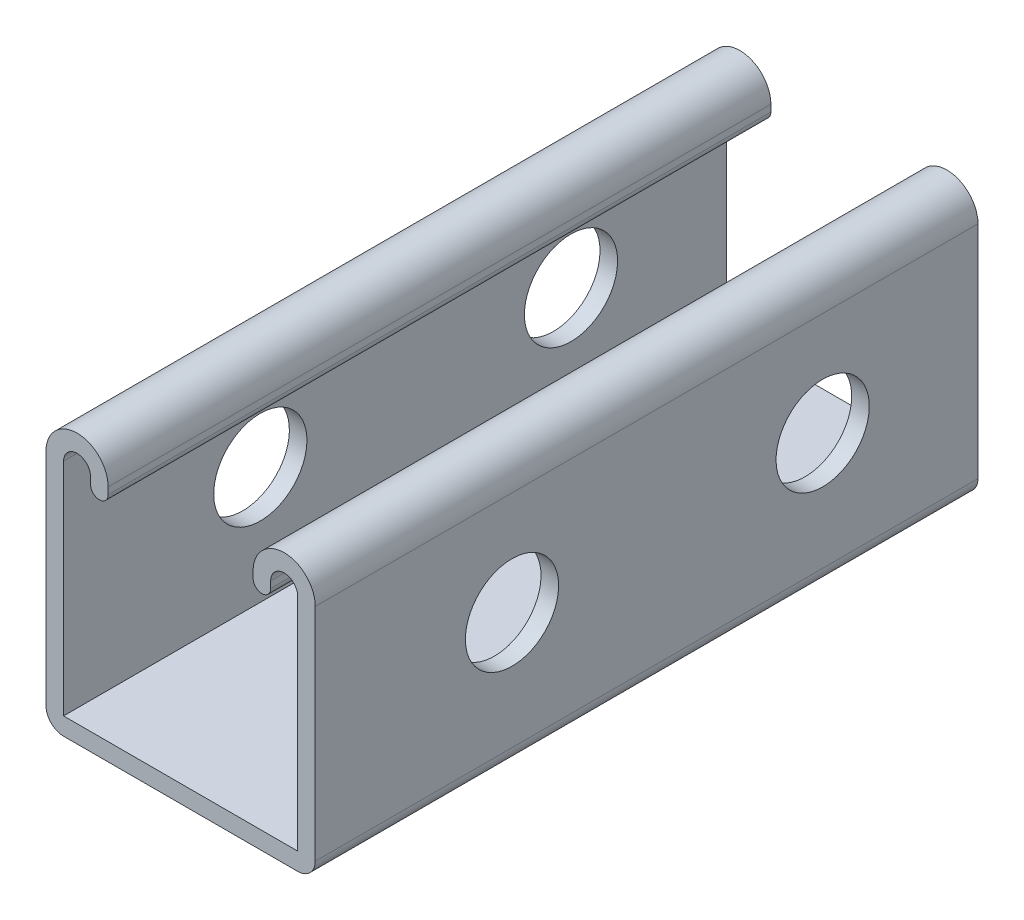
ISO-10303-21;
HEADER;
FILE_DESCRIPTION(('STEP AP214'),'2;1');
FILE_NAME('part.step','',(''),(''),'','','');
FILE_SCHEMA(('AUTOMOTIVE_DESIGN { 1 0 10303 214 1 1 1 1 }'));
ENDSEC;
DATA;
#1=APPLICATION_CONTEXT('core data for automotive mechanical design processes');
#2=APPLICATION_PROTOCOL_DEFINITION('international standard','automotive_design',2000,#1);
#3=PRODUCT_CONTEXT('',#1,'mechanical');
#4=PRODUCT('Part','Part','',(#3));
#5=PRODUCT_RELATED_PRODUCT_CATEGORY('part','',(#4));
#6=PRODUCT_DEFINITION_FORMATION('','',#4);
#7=PRODUCT_DEFINITION_CONTEXT('part definition',#1,'design');
#8=PRODUCT_DEFINITION('design','',#6,#7);
#9=PRODUCT_DEFINITION_SHAPE('','',#8);
#10=(LENGTH_UNIT() NAMED_UNIT(*) SI_UNIT(.MILLI.,.METRE.));
#11=(NAMED_UNIT(*) PLANE_ANGLE_UNIT() SI_UNIT($,.RADIAN.));
#12=(NAMED_UNIT(*) SI_UNIT($,.STERADIAN.) SOLID_ANGLE_UNIT());
#13=UNCERTAINTY_MEASURE_WITH_UNIT(LENGTH_MEASURE(1.E-05),#10,'distance_accuracy_value','');
#14=(GEOMETRIC_REPRESENTATION_CONTEXT(3) GLOBAL_UNCERTAINTY_ASSIGNED_CONTEXT((#13)) GLOBAL_UNIT_ASSIGNED_CONTEXT((#10,
#11,#12)) REPRESENTATION_CONTEXT('',''));
#15=CARTESIAN_POINT('',(0.,0.,0.));
#16=DIRECTION('',(0.,0.,1.));
#17=DIRECTION('',(1.,0.,0.));
#18=AXIS2_PLACEMENT_3D('',#15,#16,#17);
#19=CARTESIAN_POINT('',(-15.875,15.875,101.6));
#20=DIRECTION('',(0.,0.,-1.));
#21=DIRECTION('',(-1.,0.,0.));
#22=AXIS2_PLACEMENT_3D('',#19,#20,#21);
#23=CYLINDRICAL_SURFACE('',#22,4.7625);
#24=CARTESIAN_POINT('',(-15.875,15.875,0.));
#25=DIRECTION('',(0.,0.,1.));
#26=DIRECTION('',(-1.,0.,0.));
#27=AXIS2_PLACEMENT_3D('',#24,#25,#26);
#28=CIRCLE('',#27,4.7625);
#29=CARTESIAN_POINT('',(-11.1125,15.875,0.));
#30=VERTEX_POINT('',#29);
#31=CARTESIAN_POINT('',(-20.6375,15.875,0.));
#32=VERTEX_POINT('',#31);
#33=EDGE_CURVE('E197',#30,#32,#28,.T.);
#34=ORIENTED_EDGE('',*,*,#33,.T.);
#35=DIRECTION('',(0.,0.,-1.));
#36=VECTOR('',#35,1.);
#37=CARTESIAN_POINT('',(-20.6375,15.875,101.6));
#38=LINE('',#37,#36);
#39=CARTESIAN_POINT('',(-20.6375,15.875,101.6));
#40=VERTEX_POINT('',#39);
#41=EDGE_CURVE('E11',#40,#32,#38,.T.);
#42=ORIENTED_EDGE('',*,*,#41,.F.);
#43=CARTESIAN_POINT('',(-15.875,15.875,101.6));
#44=DIRECTION('',(0.,0.,1.));
#45=DIRECTION('',(-1.,0.,0.));
#46=AXIS2_PLACEMENT_3D('',#43,#44,#45);
#47=CIRCLE('',#46,4.7625);
#48=CARTESIAN_POINT('',(-11.1125,15.875,101.6));
#49=VERTEX_POINT('',#48);
#50=EDGE_CURVE('E232',#49,#40,#47,.T.);
#51=ORIENTED_EDGE('',*,*,#50,.F.);
#52=DIRECTION('',(0.,0.,-1.));
#53=VECTOR('',#52,1.);
#54=CARTESIAN_POINT('',(-11.1125,15.875,101.6));
#55=LINE('',#54,#53);
#56=EDGE_CURVE('E193',#49,#30,#55,.T.);
#57=ORIENTED_EDGE('',*,*,#56,.T.);
#58=EDGE_LOOP('',(#34,#42,#51,#57));
#59=FACE_BOUND('',#58,.T.);
#60=ADVANCED_FACE('F39',(#59),#23,.T.);
#61=CARTESIAN_POINT('',(-20.6375,15.875,101.6));
#62=DIRECTION('',(1.,0.,0.));
#63=DIRECTION('',(0.,1.,0.));
#64=AXIS2_PLACEMENT_3D('',#61,#62,#63);
#65=PLANE('',#64);
#66=CARTESIAN_POINT('',(-20.6375000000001,0.,71.4375));
#67=DIRECTION('',(1.,0.,0.));
#68=DIRECTION('',(0.,1.,0.));
#69=AXIS2_PLACEMENT_3D('',#66,#67,#68);
#70=CIRCLE('',#69,7.14375);
#71=CARTESIAN_POINT('',(-20.6375000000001,7.14374999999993,71.4375));
#72=VERTEX_POINT('',#71);
#73=EDGE_CURVE('E510',#72,#72,#70,.T.);
#74=ORIENTED_EDGE('',*,*,#73,.T.);
#75=EDGE_LOOP('',(#74));
#76=FACE_BOUND('',#75,.T.);
#77=CARTESIAN_POINT('',(-20.6375000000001,0.,23.8125));
#78=DIRECTION('',(1.,0.,0.));
#79=DIRECTION('',(0.,1.,0.));
#80=AXIS2_PLACEMENT_3D('',#77,#78,#79);
#81=CIRCLE('',#80,7.14375);
#82=CARTESIAN_POINT('',(-20.6375000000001,7.14374999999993,23.8125));
#83=VERTEX_POINT('',#82);
#84=EDGE_CURVE('E279',#83,#83,#81,.T.);
#85=ORIENTED_EDGE('',*,*,#84,.T.);
#86=EDGE_LOOP('',(#85));
#87=FACE_BOUND('',#86,.T.);
#88=DIRECTION('',(0.,-1.,0.));
#89=VECTOR('',#88,1.);
#90=CARTESIAN_POINT('',(-20.6375,15.875,0.));
#91=LINE('',#90,#89);
#92=CARTESIAN_POINT('',(-20.6375,-17.9451,0.));
#93=VERTEX_POINT('',#92);
#94=EDGE_CURVE('E200',#32,#93,#91,.T.);
#95=ORIENTED_EDGE('',*,*,#94,.T.);
#96=DIRECTION('',(0.,0.,-1.));
#97=VECTOR('',#96,1.);
#98=CARTESIAN_POINT('',(-20.6375,-17.9451,101.6));
#99=LINE('',#98,#97);
#100=CARTESIAN_POINT('',(-20.6375,-17.9451,101.6));
#101=VERTEX_POINT('',#100);
#102=EDGE_CURVE('E48',#101,#93,#99,.T.);
#103=ORIENTED_EDGE('',*,*,#102,.F.);
#104=DIRECTION('',(0.,-1.,0.));
#105=VECTOR('',#104,1.);
#106=CARTESIAN_POINT('',(-20.6375,15.875,101.6));
#107=LINE('',#106,#105);
#108=EDGE_CURVE('E130',#40,#101,#107,.T.);
#109=ORIENTED_EDGE('',*,*,#108,.F.);
#110=ORIENTED_EDGE('',*,*,#41,.T.);
#111=EDGE_LOOP('',(#95,#103,#109,#110));
#112=FACE_BOUND('',#111,.T.);
#113=ADVANCED_FACE('F356',(#76,#87,#112),#65,.F.);
#114=CARTESIAN_POINT('',(-17.9451,-17.9451,101.6));
#115=DIRECTION('',(0.,0.,-1.));
#116=DIRECTION('',(-1.,0.,0.));
#117=AXIS2_PLACEMENT_3D('',#114,#115,#116);
#118=CYLINDRICAL_SURFACE('',#117,2.6924);
#119=CARTESIAN_POINT('',(-17.9451,-17.9451,0.));
#120=DIRECTION('',(0.,0.,1.));
#121=DIRECTION('',(-1.,0.,0.));
#122=AXIS2_PLACEMENT_3D('',#119,#120,#121);
#123=CIRCLE('',#122,2.6924);
#124=CARTESIAN_POINT('',(-17.9451,-20.6375,0.));
#125=VERTEX_POINT('',#124);
#126=EDGE_CURVE('E203',#93,#125,#123,.T.);
#127=ORIENTED_EDGE('',*,*,#126,.T.);
#128=DIRECTION('',(0.,0.,-1.));
#129=VECTOR('',#128,1.);
#130=CARTESIAN_POINT('',(-17.9451,-20.6375,101.6));
#131=LINE('',#130,#129);
#132=CARTESIAN_POINT('',(-17.9451,-20.6375,101.6));
#133=VERTEX_POINT('',#132);
#134=EDGE_CURVE('E269',#133,#125,#131,.T.);
#135=ORIENTED_EDGE('',*,*,#134,.F.);
#136=CARTESIAN_POINT('',(-17.9451,-17.9451,101.6));
#137=DIRECTION('',(0.,0.,1.));
#138=DIRECTION('',(-1.,0.,0.));
#139=AXIS2_PLACEMENT_3D('',#136,#137,#138);
#140=CIRCLE('',#139,2.6924);
#141=EDGE_CURVE('E305',#101,#133,#140,.T.);
#142=ORIENTED_EDGE('',*,*,#141,.F.);
#143=ORIENTED_EDGE('',*,*,#102,.T.);
#144=EDGE_LOOP('',(#127,#135,#142,#143));
#145=FACE_BOUND('',#144,.T.);
#146=ADVANCED_FACE('F361',(#145),#118,.T.);
#147=CARTESIAN_POINT('',(-17.9451,-20.6375,101.6));
#148=DIRECTION('',(0.,1.,0.));
#149=DIRECTION('',(-1.,0.,0.));
#150=AXIS2_PLACEMENT_3D('',#147,#148,#149);
#151=PLANE('',#150);
#152=CARTESIAN_POINT('',(0.,-20.6375,71.4375));
#153=DIRECTION('',(0.,-1.,0.));
#154=DIRECTION('',(1.,0.,0.));
#155=AXIS2_PLACEMENT_3D('',#152,#153,#154);
#156=CIRCLE('',#155,7.14375);
#157=CARTESIAN_POINT('',(7.14375,-20.6375,71.4375));
#158=VERTEX_POINT('',#157);
#159=EDGE_CURVE('E283',#158,#158,#156,.T.);
#160=ORIENTED_EDGE('',*,*,#159,.F.);
#161=EDGE_LOOP('',(#160));
#162=FACE_BOUND('',#161,.T.);
#163=CARTESIAN_POINT('',(0.,-20.6375,23.8125));
#164=DIRECTION('',(0.,-1.,0.));
#165=DIRECTION('',(1.,0.,0.));
#166=AXIS2_PLACEMENT_3D('',#163,#164,#165);
#167=CIRCLE('',#166,7.14375);
#168=CARTESIAN_POINT('',(7.14375,-20.6375,23.8125));
#169=VERTEX_POINT('',#168);
#170=EDGE_CURVE('E275',#169,#169,#167,.T.);
#171=ORIENTED_EDGE('',*,*,#170,.F.);
#172=EDGE_LOOP('',(#171));
#173=FACE_BOUND('',#172,.T.);
#174=DIRECTION('',(1.,0.,0.));
#175=VECTOR('',#174,1.);
#176=CARTESIAN_POINT('',(-17.9451,-20.6375,0.));
#177=LINE('',#176,#175);
#178=CARTESIAN_POINT('',(17.9451,-20.6375,0.));
#179=VERTEX_POINT('',#178);
#180=EDGE_CURVE('E205',#125,#179,#177,.T.);
#181=ORIENTED_EDGE('',*,*,#180,.T.);
#182=DIRECTION('',(0.,0.,-1.));
#183=VECTOR('',#182,1.);
#184=CARTESIAN_POINT('',(17.9451,-20.6375,101.6));
#185=LINE('',#184,#183);
#186=CARTESIAN_POINT('',(17.9451,-20.6375,101.6));
#187=VERTEX_POINT('',#186);
#188=EDGE_CURVE('E266',#187,#179,#185,.T.);
#189=ORIENTED_EDGE('',*,*,#188,.F.);
#190=DIRECTION('',(1.,0.,0.));
#191=VECTOR('',#190,1.);
#192=CARTESIAN_POINT('',(-17.9451,-20.6375,101.6));
#193=LINE('',#192,#191);
#194=EDGE_CURVE('E307',#133,#187,#193,.T.);
#195=ORIENTED_EDGE('',*,*,#194,.F.);
#196=ORIENTED_EDGE('',*,*,#134,.T.);
#197=EDGE_LOOP('',(#181,#189,#195,#196));
#198=FACE_BOUND('',#197,.T.);
#199=ADVANCED_FACE('F367',(#162,#173,#198),#151,.F.);
#200=CARTESIAN_POINT('',(17.9451,-17.9451,101.6));
#201=DIRECTION('',(0.,0.,-1.));
#202=DIRECTION('',(-1.,0.,0.));
#203=AXIS2_PLACEMENT_3D('',#200,#201,#202);
#204=CYLINDRICAL_SURFACE('',#203,2.6924);
#205=CARTESIAN_POINT('',(17.9451,-17.9451,0.));
#206=DIRECTION('',(0.,0.,1.));
#207=DIRECTION('',(1.,0.,0.));
#208=AXIS2_PLACEMENT_3D('',#205,#206,#207);
#209=CIRCLE('',#208,2.6924);
#210=CARTESIAN_POINT('',(20.6375,-17.9451,0.));
#211=VERTEX_POINT('',#210);
#212=EDGE_CURVE('E207',#179,#211,#209,.T.);
#213=ORIENTED_EDGE('',*,*,#212,.T.);
#214=DIRECTION('',(0.,0.,-1.));
#215=VECTOR('',#214,1.);
#216=CARTESIAN_POINT('',(20.6375,-17.9451,101.6));
#217=LINE('',#216,#215);
#218=CARTESIAN_POINT('',(20.6375,-17.9451,101.6));
#219=VERTEX_POINT('',#218);
#220=EDGE_CURVE('E263',#219,#211,#217,.T.);
#221=ORIENTED_EDGE('',*,*,#220,.F.);
#222=CARTESIAN_POINT('',(17.9451,-17.9451,101.6));
#223=DIRECTION('',(0.,0.,1.));
#224=DIRECTION('',(1.,0.,0.));
#225=AXIS2_PLACEMENT_3D('',#222,#223,#224);
#226=CIRCLE('',#225,2.6924);
#227=EDGE_CURVE('E309',#187,#219,#226,.T.);
#228=ORIENTED_EDGE('',*,*,#227,.F.);
#229=ORIENTED_EDGE('',*,*,#188,.T.);
#230=EDGE_LOOP('',(#213,#221,#228,#229));
#231=FACE_BOUND('',#230,.T.);
#232=ADVANCED_FACE('F374',(#231),#204,.T.);
#233=CARTESIAN_POINT('',(20.6375,-17.9451,101.6));
#234=DIRECTION('',(-1.,0.,0.));
#235=DIRECTION('',(0.,0.,1.));
#236=AXIS2_PLACEMENT_3D('',#233,#234,#235);
#237=PLANE('',#236);
#238=CARTESIAN_POINT('',(20.6375,0.,71.4375));
#239=DIRECTION('',(1.,0.,0.));
#240=DIRECTION('',(0.,1.,0.));
#241=AXIS2_PLACEMENT_3D('',#238,#239,#240);
#242=CIRCLE('',#241,7.14375);
#243=CARTESIAN_POINT('',(20.6375,7.14375000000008,71.4375));
#244=VERTEX_POINT('',#243);
#245=EDGE_CURVE('E506',#244,#244,#242,.T.);
#246=ORIENTED_EDGE('',*,*,#245,.F.);
#247=EDGE_LOOP('',(#246));
#248=FACE_BOUND('',#247,.T.);
#249=CARTESIAN_POINT('',(20.6375,0.,23.8125));
#250=DIRECTION('',(1.,0.,0.));
#251=DIRECTION('',(0.,1.,0.));
#252=AXIS2_PLACEMENT_3D('',#249,#250,#251);
#253=CIRCLE('',#252,7.14375);
#254=CARTESIAN_POINT('',(20.6375,7.14375000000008,23.8125));
#255=VERTEX_POINT('',#254);
#256=EDGE_CURVE('E286',#255,#255,#253,.T.);
#257=ORIENTED_EDGE('',*,*,#256,.F.);
#258=EDGE_LOOP('',(#257));
#259=FACE_BOUND('',#258,.T.);
#260=DIRECTION('',(0.,1.,0.));
#261=VECTOR('',#260,1.);
#262=CARTESIAN_POINT('',(20.6375,-17.9451,0.));
#263=LINE('',#262,#261);
#264=CARTESIAN_POINT('',(20.6375,15.875,0.));
#265=VERTEX_POINT('',#264);
#266=EDGE_CURVE('E209',#211,#265,#263,.T.);
#267=ORIENTED_EDGE('',*,*,#266,.T.);
#268=DIRECTION('',(0.,0.,-1.));
#269=VECTOR('',#268,1.);
#270=CARTESIAN_POINT('',(20.6375,15.875,101.6));
#271=LINE('',#270,#269);
#272=CARTESIAN_POINT('',(20.6375,15.875,101.6));
#273=VERTEX_POINT('',#272);
#274=EDGE_CURVE('E260',#273,#265,#271,.T.);
#275=ORIENTED_EDGE('',*,*,#274,.F.);
#276=DIRECTION('',(0.,1.,0.));
#277=VECTOR('',#276,1.);
#278=CARTESIAN_POINT('',(20.6375,-17.9451,101.6));
#279=LINE('',#278,#277);
#280=EDGE_CURVE('E311',#219,#273,#279,.T.);
#281=ORIENTED_EDGE('',*,*,#280,.F.);
#282=ORIENTED_EDGE('',*,*,#220,.T.);
#283=EDGE_LOOP('',(#267,#275,#281,#282));
#284=FACE_BOUND('',#283,.T.);
#285=ADVANCED_FACE('F378',(#248,#259,#284),#237,.F.);
#286=CARTESIAN_POINT('',(15.875,15.875,101.6));
#287=DIRECTION('',(0.,0.,-1.));
#288=DIRECTION('',(-1.,0.,0.));
#289=AXIS2_PLACEMENT_3D('',#286,#287,#288);
#290=CYLINDRICAL_SURFACE('',#289,4.7625);
#291=CARTESIAN_POINT('',(15.875,15.875,0.));
#292=DIRECTION('',(0.,0.,1.));
#293=DIRECTION('',(1.,0.,0.));
#294=AXIS2_PLACEMENT_3D('',#291,#292,#293);
#295=CIRCLE('',#294,4.7625);
#296=CARTESIAN_POINT('',(11.1125,15.875,0.));
#297=VERTEX_POINT('',#296);
#298=EDGE_CURVE('E211',#265,#297,#295,.T.);
#299=ORIENTED_EDGE('',*,*,#298,.T.);
#300=DIRECTION('',(0.,0.,-1.));
#301=VECTOR('',#300,1.);
#302=CARTESIAN_POINT('',(11.1125,15.875,101.6));
#303=LINE('',#302,#301);
#304=CARTESIAN_POINT('',(11.1125,15.875,101.6));
#305=VERTEX_POINT('',#304);
#306=EDGE_CURVE('E257',#305,#297,#303,.T.);
#307=ORIENTED_EDGE('',*,*,#306,.F.);
#308=CARTESIAN_POINT('',(15.875,15.875,101.6));
#309=DIRECTION('',(0.,0.,1.));
#310=DIRECTION('',(1.,0.,0.));
#311=AXIS2_PLACEMENT_3D('',#308,#309,#310);
#312=CIRCLE('',#311,4.7625);
#313=EDGE_CURVE('E313',#273,#305,#312,.T.);
#314=ORIENTED_EDGE('',*,*,#313,.F.);
#315=ORIENTED_EDGE('',*,*,#274,.T.);
#316=EDGE_LOOP('',(#299,#307,#314,#315));
#317=FACE_BOUND('',#316,.T.);
#318=ADVANCED_FACE('F381',(#317),#290,.T.);
#319=CARTESIAN_POINT('',(11.1125,15.875,101.6));
#320=DIRECTION('',(1.,0.,0.));
#321=DIRECTION('',(0.,1.,0.));
#322=AXIS2_PLACEMENT_3D('',#319,#320,#321);
#323=PLANE('',#322);
#324=DIRECTION('',(0.,-1.,0.));
#325=VECTOR('',#324,1.);
#326=CARTESIAN_POINT('',(11.1125,15.875,0.));
#327=LINE('',#326,#325);
#328=CARTESIAN_POINT('',(11.1125,14.83995,0.));
#329=VERTEX_POINT('',#328);
#330=EDGE_CURVE('E213',#297,#329,#327,.T.);
#331=ORIENTED_EDGE('',*,*,#330,.T.);
#332=DIRECTION('',(0.,0.,-1.));
#333=VECTOR('',#332,1.);
#334=CARTESIAN_POINT('',(11.1125,14.83995,101.6));
#335=LINE('',#334,#333);
#336=CARTESIAN_POINT('',(11.1125,14.83995,101.6));
#337=VERTEX_POINT('',#336);
#338=EDGE_CURVE('E254',#337,#329,#335,.T.);
#339=ORIENTED_EDGE('',*,*,#338,.F.);
#340=DIRECTION('',(0.,-1.,0.));
#341=VECTOR('',#340,1.);
#342=CARTESIAN_POINT('',(11.1125,15.875,101.6));
#343=LINE('',#342,#341);
#344=EDGE_CURVE('E315',#305,#337,#343,.T.);
#345=ORIENTED_EDGE('',*,*,#344,.F.);
#346=ORIENTED_EDGE('',*,*,#306,.T.);
#347=EDGE_LOOP('',(#331,#339,#345,#346));
#348=FACE_BOUND('',#347,.T.);
#349=ADVANCED_FACE('F385',(#348),#323,.F.);
#350=CARTESIAN_POINT('',(12.4587,14.83995,101.6));
#351=DIRECTION('',(0.,0.,-1.));
#352=DIRECTION('',(-1.,0.,0.));
#353=AXIS2_PLACEMENT_3D('',#350,#351,#352);
#354=CYLINDRICAL_SURFACE('',#353,1.3462);
#355=CARTESIAN_POINT('',(12.4587,14.83995,0.));
#356=DIRECTION('',(0.,0.,1.));
#357=DIRECTION('',(1.,0.,0.));
#358=AXIS2_PLACEMENT_3D('',#355,#356,#357);
#359=CIRCLE('',#358,1.3462);
#360=CARTESIAN_POINT('',(13.8049,14.83995,0.));
#361=VERTEX_POINT('',#360);
#362=EDGE_CURVE('E215',#329,#361,#359,.T.);
#363=ORIENTED_EDGE('',*,*,#362,.T.);
#364=DIRECTION('',(0.,0.,-1.));
#365=VECTOR('',#364,1.);
#366=CARTESIAN_POINT('',(13.8049,14.83995,101.6));
#367=LINE('',#366,#365);
#368=CARTESIAN_POINT('',(13.8049,14.83995,101.6));
#369=VERTEX_POINT('',#368);
#370=EDGE_CURVE('E251',#369,#361,#367,.T.);
#371=ORIENTED_EDGE('',*,*,#370,.F.);
#372=CARTESIAN_POINT('',(12.4587,14.83995,101.6));
#373=DIRECTION('',(0.,0.,1.));
#374=DIRECTION('',(1.,0.,0.));
#375=AXIS2_PLACEMENT_3D('',#372,#373,#374);
#376=CIRCLE('',#375,1.3462);
#377=EDGE_CURVE('E317',#337,#369,#376,.T.);
#378=ORIENTED_EDGE('',*,*,#377,.F.);
#379=ORIENTED_EDGE('',*,*,#338,.T.);
#380=EDGE_LOOP('',(#363,#371,#378,#379));
#381=FACE_BOUND('',#380,.T.);
#382=ADVANCED_FACE('F389',(#381),#354,.T.);
#383=CARTESIAN_POINT('',(13.8049,15.875,101.6));
#384=DIRECTION('',(-1.,0.,0.));
#385=DIRECTION('',(0.,0.,1.));
#386=AXIS2_PLACEMENT_3D('',#383,#384,#385);
#387=PLANE('',#386);
#388=DIRECTION('',(0.,1.,0.));
#389=VECTOR('',#388,1.);
#390=CARTESIAN_POINT('',(13.8049,15.875,0.));
#391=LINE('',#390,#389);
#392=CARTESIAN_POINT('',(13.8049,15.875,0.));
#393=VERTEX_POINT('',#392);
#394=EDGE_CURVE('E217',#361,#393,#391,.T.);
#395=ORIENTED_EDGE('',*,*,#394,.T.);
#396=DIRECTION('',(0.,0.,-1.));
#397=VECTOR('',#396,1.);
#398=CARTESIAN_POINT('',(13.8049,15.875,101.6));
#399=LINE('',#398,#397);
#400=CARTESIAN_POINT('',(13.8049,15.875,101.6));
#401=VERTEX_POINT('',#400);
#402=EDGE_CURVE('E248',#401,#393,#399,.T.);
#403=ORIENTED_EDGE('',*,*,#402,.F.);
#404=DIRECTION('',(0.,1.,0.));
#405=VECTOR('',#404,1.);
#406=CARTESIAN_POINT('',(13.8049,15.875,101.6));
#407=LINE('',#406,#405);
#408=EDGE_CURVE('E319',#369,#401,#407,.T.);
#409=ORIENTED_EDGE('',*,*,#408,.F.);
#410=ORIENTED_EDGE('',*,*,#370,.T.);
#411=EDGE_LOOP('',(#395,#403,#409,#410));
#412=FACE_BOUND('',#411,.T.);
#413=ADVANCED_FACE('F393',(#412),#387,.F.);
#414=CARTESIAN_POINT('',(15.875,15.875,101.6));
#415=DIRECTION('',(0.,0.,-1.));
#416=DIRECTION('',(-1.,0.,0.));
#417=AXIS2_PLACEMENT_3D('',#414,#415,#416);
#418=CYLINDRICAL_SURFACE('',#417,2.0701);
#419=CARTESIAN_POINT('',(15.875,15.875,0.));
#420=DIRECTION('',(0.,0.,-1.));
#421=DIRECTION('',(1.,0.,0.));
#422=AXIS2_PLACEMENT_3D('',#419,#420,#421);
#423=CIRCLE('',#422,2.0701);
#424=CARTESIAN_POINT('',(17.9451,15.875,0.));
#425=VERTEX_POINT('',#424);
#426=EDGE_CURVE('E219',#393,#425,#423,.T.);
#427=ORIENTED_EDGE('',*,*,#426,.T.);
#428=DIRECTION('',(0.,0.,-1.));
#429=VECTOR('',#428,1.);
#430=CARTESIAN_POINT('',(17.9451,15.875,101.6));
#431=LINE('',#430,#429);
#432=CARTESIAN_POINT('',(17.9451,15.875,101.6));
#433=VERTEX_POINT('',#432);
#434=EDGE_CURVE('E245',#433,#425,#431,.T.);
#435=ORIENTED_EDGE('',*,*,#434,.F.);
#436=CARTESIAN_POINT('',(15.875,15.875,101.6));
#437=DIRECTION('',(0.,0.,-1.));
#438=DIRECTION('',(1.,0.,0.));
#439=AXIS2_PLACEMENT_3D('',#436,#437,#438);
#440=CIRCLE('',#439,2.0701);
#441=EDGE_CURVE('E321',#401,#433,#440,.T.);
#442=ORIENTED_EDGE('',*,*,#441,.F.);
#443=ORIENTED_EDGE('',*,*,#402,.T.);
#444=EDGE_LOOP('',(#427,#435,#442,#443));
#445=FACE_BOUND('',#444,.T.);
#446=ADVANCED_FACE('F397',(#445),#418,.F.);
#447=CARTESIAN_POINT('',(17.9451,-17.9451,101.6));
#448=DIRECTION('',(1.,0.,0.));
#449=DIRECTION('',(0.,1.,0.));
#450=AXIS2_PLACEMENT_3D('',#447,#448,#449);
#451=PLANE('',#450);
#452=CARTESIAN_POINT('',(17.9451,0.,71.4375));
#453=DIRECTION('',(1.,0.,0.));
#454=DIRECTION('',(0.,1.,0.));
#455=AXIS2_PLACEMENT_3D('',#452,#453,#454);
#456=CIRCLE('',#455,7.14375);
#457=CARTESIAN_POINT('',(17.9451,7.14375000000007,71.4375));
#458=VERTEX_POINT('',#457);
#459=EDGE_CURVE('E291',#458,#458,#456,.T.);
#460=ORIENTED_EDGE('',*,*,#459,.T.);
#461=EDGE_LOOP('',(#460));
#462=FACE_BOUND('',#461,.T.);
#463=CARTESIAN_POINT('',(17.9451,0.,23.8125));
#464=DIRECTION('',(1.,0.,0.));
#465=DIRECTION('',(0.,1.,0.));
#466=AXIS2_PLACEMENT_3D('',#463,#464,#465);
#467=CIRCLE('',#466,7.14375);
#468=CARTESIAN_POINT('',(17.9451,7.14375000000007,23.8125));
#469=VERTEX_POINT('',#468);
#470=EDGE_CURVE('E278',#469,#469,#467,.T.);
#471=ORIENTED_EDGE('',*,*,#470,.T.);
#472=EDGE_LOOP('',(#471));
#473=FACE_BOUND('',#472,.T.);
#474=DIRECTION('',(0.,-1.,0.));
#475=VECTOR('',#474,1.);
#476=CARTESIAN_POINT('',(17.9451,-17.9451,0.));
#477=LINE('',#476,#475);
#478=CARTESIAN_POINT('',(17.9451,-17.9451,0.));
#479=VERTEX_POINT('',#478);
#480=EDGE_CURVE('E221',#425,#479,#477,.T.);
#481=ORIENTED_EDGE('',*,*,#480,.T.);
#482=DIRECTION('',(0.,0.,-1.));
#483=VECTOR('',#482,1.);
#484=CARTESIAN_POINT('',(17.9451,-17.9451,101.6));
#485=LINE('',#484,#483);
#486=CARTESIAN_POINT('',(17.9451,-17.9451,101.6));
#487=VERTEX_POINT('',#486);
#488=EDGE_CURVE('E242',#487,#479,#485,.T.);
#489=ORIENTED_EDGE('',*,*,#488,.F.);
#490=DIRECTION('',(0.,-1.,0.));
#491=VECTOR('',#490,1.);
#492=CARTESIAN_POINT('',(17.9451,-17.9451,101.6));
#493=LINE('',#492,#491);
#494=EDGE_CURVE('E323',#433,#487,#493,.T.);
#495=ORIENTED_EDGE('',*,*,#494,.F.);
#496=ORIENTED_EDGE('',*,*,#434,.T.);
#497=EDGE_LOOP('',(#481,#489,#495,#496));
#498=FACE_BOUND('',#497,.T.);
#499=ADVANCED_FACE('F401',(#462,#473,#498),#451,.F.);
#500=CARTESIAN_POINT('',(-17.9451,-17.9451,101.6));
#501=DIRECTION('',(0.,-1.,0.));
#502=DIRECTION('',(0.,0.,-1.));
#503=AXIS2_PLACEMENT_3D('',#500,#501,#502);
#504=PLANE('',#503);
#505=CARTESIAN_POINT('',(0.,-17.9451,71.4375));
#506=DIRECTION('',(0.,-1.,0.));
#507=DIRECTION('',(0.,0.,-1.));
#508=AXIS2_PLACEMENT_3D('',#505,#506,#507);
#509=CIRCLE('',#508,7.14375);
#510=CARTESIAN_POINT('',(0.,-17.9451,64.29375));
#511=VERTEX_POINT('',#510);
#512=EDGE_CURVE('E298',#511,#511,#509,.T.);
#513=ORIENTED_EDGE('',*,*,#512,.T.);
#514=EDGE_LOOP('',(#513));
#515=FACE_BOUND('',#514,.T.);
#516=CARTESIAN_POINT('',(0.,-17.9451,23.8125));
#517=DIRECTION('',(0.,-1.,0.));
#518=DIRECTION('',(0.,0.,-1.));
#519=AXIS2_PLACEMENT_3D('',#516,#517,#518);
#520=CIRCLE('',#519,7.14375);
#521=CARTESIAN_POINT('',(0.,-17.9451,16.66875));
#522=VERTEX_POINT('',#521);
#523=EDGE_CURVE('E201',#522,#522,#520,.T.);
#524=ORIENTED_EDGE('',*,*,#523,.T.);
#525=EDGE_LOOP('',(#524));
#526=FACE_BOUND('',#525,.T.);
#527=DIRECTION('',(-1.,0.,0.));
#528=VECTOR('',#527,1.);
#529=CARTESIAN_POINT('',(-17.9451,-17.9451,0.));
#530=LINE('',#529,#528);
#531=CARTESIAN_POINT('',(-17.9451,-17.9451,0.));
#532=VERTEX_POINT('',#531);
#533=EDGE_CURVE('E223',#479,#532,#530,.T.);
#534=ORIENTED_EDGE('',*,*,#533,.T.);
#535=DIRECTION('',(0.,0.,-1.));
#536=VECTOR('',#535,1.);
#537=CARTESIAN_POINT('',(-17.9451,-17.9451,101.6));
#538=LINE('',#537,#536);
#539=CARTESIAN_POINT('',(-17.9451,-17.9451,101.6));
#540=VERTEX_POINT('',#539);
#541=EDGE_CURVE('E239',#540,#532,#538,.T.);
#542=ORIENTED_EDGE('',*,*,#541,.F.);
#543=DIRECTION('',(-1.,0.,0.));
#544=VECTOR('',#543,1.);
#545=CARTESIAN_POINT('',(-17.9451,-17.9451,101.6));
#546=LINE('',#545,#544);
#547=EDGE_CURVE('E325',#487,#540,#546,.T.);
#548=ORIENTED_EDGE('',*,*,#547,.F.);
#549=ORIENTED_EDGE('',*,*,#488,.T.);
#550=EDGE_LOOP('',(#534,#542,#548,#549));
#551=FACE_BOUND('',#550,.T.);
#552=ADVANCED_FACE('F405',(#515,#526,#551),#504,.F.);
#553=CARTESIAN_POINT('',(-17.9451,15.875,101.6));
#554=DIRECTION('',(-1.,0.,0.));
#555=DIRECTION('',(0.,0.,1.));
#556=AXIS2_PLACEMENT_3D('',#553,#554,#555);
#557=PLANE('',#556);
#558=CARTESIAN_POINT('',(-17.9451,0.,71.4375));
#559=DIRECTION('',(-1.,0.,0.));
#560=DIRECTION('',(0.,0.,1.));
#561=AXIS2_PLACEMENT_3D('',#558,#559,#560);
#562=CIRCLE('',#561,7.14375);
#563=CARTESIAN_POINT('',(-17.9451,7.14374999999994,71.4375));
#564=VERTEX_POINT('',#563);
#565=EDGE_CURVE('E42',#564,#564,#562,.T.);
#566=ORIENTED_EDGE('',*,*,#565,.T.);
#567=EDGE_LOOP('',(#566));
#568=FACE_BOUND('',#567,.T.);
#569=CARTESIAN_POINT('',(-17.9451,0.,23.8125));
#570=DIRECTION('',(-1.,0.,0.));
#571=DIRECTION('',(0.,0.,1.));
#572=AXIS2_PLACEMENT_3D('',#569,#570,#571);
#573=CIRCLE('',#572,7.14375);
#574=CARTESIAN_POINT('',(-17.9451,7.14374999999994,23.8125));
#575=VERTEX_POINT('',#574);
#576=EDGE_CURVE('E276',#575,#575,#573,.T.);
#577=ORIENTED_EDGE('',*,*,#576,.T.);
#578=EDGE_LOOP('',(#577));
#579=FACE_BOUND('',#578,.T.);
#580=DIRECTION('',(0.,1.,0.));
#581=VECTOR('',#580,1.);
#582=CARTESIAN_POINT('',(-17.9451,15.875,0.));
#583=LINE('',#582,#581);
#584=CARTESIAN_POINT('',(-17.9451,15.875,0.));
#585=VERTEX_POINT('',#584);
#586=EDGE_CURVE('E225',#532,#585,#583,.T.);
#587=ORIENTED_EDGE('',*,*,#586,.T.);
#588=DIRECTION('',(0.,0.,-1.));
#589=VECTOR('',#588,1.);
#590=CARTESIAN_POINT('',(-17.9451,15.875,101.6));
#591=LINE('',#590,#589);
#592=CARTESIAN_POINT('',(-17.9451,15.875,101.6));
#593=VERTEX_POINT('',#592);
#594=EDGE_CURVE('E236',#593,#585,#591,.T.);
#595=ORIENTED_EDGE('',*,*,#594,.F.);
#596=DIRECTION('',(0.,1.,0.));
#597=VECTOR('',#596,1.);
#598=CARTESIAN_POINT('',(-17.9451,15.875,101.6));
#599=LINE('',#598,#597);
#600=EDGE_CURVE('E327',#540,#593,#599,.T.);
#601=ORIENTED_EDGE('',*,*,#600,.F.);
#602=ORIENTED_EDGE('',*,*,#541,.T.);
#603=EDGE_LOOP('',(#587,#595,#601,#602));
#604=FACE_BOUND('',#603,.T.);
#605=ADVANCED_FACE('F333',(#568,#579,#604),#557,.F.);
#606=CARTESIAN_POINT('',(-15.875,15.875,101.6));
#607=DIRECTION('',(0.,0.,-1.));
#608=DIRECTION('',(-1.,0.,0.));
#609=AXIS2_PLACEMENT_3D('',#606,#607,#608);
#610=CYLINDRICAL_SURFACE('',#609,2.0701);
#611=CARTESIAN_POINT('',(-15.875,15.875,0.));
#612=DIRECTION('',(0.,0.,-1.));
#613=DIRECTION('',(-1.,0.,0.));
#614=AXIS2_PLACEMENT_3D('',#611,#612,#613);
#615=CIRCLE('',#614,2.0701);
#616=CARTESIAN_POINT('',(-13.8049,15.875,0.));
#617=VERTEX_POINT('',#616);
#618=EDGE_CURVE('E227',#585,#617,#615,.T.);
#619=ORIENTED_EDGE('',*,*,#618,.T.);
#620=DIRECTION('',(0.,0.,-1.));
#621=VECTOR('',#620,1.);
#622=CARTESIAN_POINT('',(-13.8049,15.875,101.6));
#623=LINE('',#622,#621);
#624=CARTESIAN_POINT('',(-13.8049,15.875,101.6));
#625=VERTEX_POINT('',#624);
#626=EDGE_CURVE('E188',#625,#617,#623,.T.);
#627=ORIENTED_EDGE('',*,*,#626,.F.);
#628=CARTESIAN_POINT('',(-15.875,15.875,101.6));
#629=DIRECTION('',(0.,0.,-1.));
#630=DIRECTION('',(-1.,0.,0.));
#631=AXIS2_PLACEMENT_3D('',#628,#629,#630);
#632=CIRCLE('',#631,2.0701);
#633=EDGE_CURVE('E179',#593,#625,#632,.T.);
#634=ORIENTED_EDGE('',*,*,#633,.F.);
#635=ORIENTED_EDGE('',*,*,#594,.T.);
#636=EDGE_LOOP('',(#619,#627,#634,#635));
#637=FACE_BOUND('',#636,.T.);
#638=ADVANCED_FACE('F337',(#637),#610,.F.);
#639=CARTESIAN_POINT('',(-13.8049,15.875,101.6));
#640=DIRECTION('',(1.,0.,0.));
#641=DIRECTION('',(0.,1.,0.));
#642=AXIS2_PLACEMENT_3D('',#639,#640,#641);
#643=PLANE('',#642);
#644=DIRECTION('',(0.,-1.,0.));
#645=VECTOR('',#644,1.);
#646=CARTESIAN_POINT('',(-13.8049,15.875,0.));
#647=LINE('',#646,#645);
#648=CARTESIAN_POINT('',(-13.8049,14.83995,0.));
#649=VERTEX_POINT('',#648);
#650=EDGE_CURVE('E187',#617,#649,#647,.T.);
#651=ORIENTED_EDGE('',*,*,#650,.T.);
#652=DIRECTION('',(0.,0.,-1.));
#653=VECTOR('',#652,1.);
#654=CARTESIAN_POINT('',(-13.8049,14.83995,101.6));
#655=LINE('',#654,#653);
#656=CARTESIAN_POINT('',(-13.8049,14.83995,101.6));
#657=VERTEX_POINT('',#656);
#658=EDGE_CURVE('E184',#657,#649,#655,.T.);
#659=ORIENTED_EDGE('',*,*,#658,.F.);
#660=DIRECTION('',(0.,-1.,0.));
#661=VECTOR('',#660,1.);
#662=CARTESIAN_POINT('',(-13.8049,15.875,101.6));
#663=LINE('',#662,#661);
#664=EDGE_CURVE('E173',#625,#657,#663,.T.);
#665=ORIENTED_EDGE('',*,*,#664,.F.);
#666=ORIENTED_EDGE('',*,*,#626,.T.);
#667=EDGE_LOOP('',(#651,#659,#665,#666));
#668=FACE_BOUND('',#667,.T.);
#669=ADVANCED_FACE('F185',(#668),#643,.F.);
#670=CARTESIAN_POINT('',(-12.4587,14.83995,101.6));
#671=DIRECTION('',(0.,0.,-1.));
#672=DIRECTION('',(-1.,0.,0.));
#673=AXIS2_PLACEMENT_3D('',#670,#671,#672);
#674=CYLINDRICAL_SURFACE('',#673,1.3462);
#675=CARTESIAN_POINT('',(-12.4587,14.83995,0.));
#676=DIRECTION('',(0.,0.,1.));
#677=DIRECTION('',(-1.,0.,0.));
#678=AXIS2_PLACEMENT_3D('',#675,#676,#677);
#679=CIRCLE('',#678,1.3462);
#680=CARTESIAN_POINT('',(-11.1125,14.83995,0.));
#681=VERTEX_POINT('',#680);
#682=EDGE_CURVE('E116',#649,#681,#679,.T.);
#683=ORIENTED_EDGE('',*,*,#682,.T.);
#684=DIRECTION('',(0.,0.,-1.));
#685=VECTOR('',#684,1.);
#686=CARTESIAN_POINT('',(-11.1125,14.83995,101.6));
#687=LINE('',#686,#685);
#688=CARTESIAN_POINT('',(-11.1125,14.83995,101.6));
#689=VERTEX_POINT('',#688);
#690=EDGE_CURVE('E189',#689,#681,#687,.T.);
#691=ORIENTED_EDGE('',*,*,#690,.F.);
#692=CARTESIAN_POINT('',(-12.4587,14.83995,101.6));
#693=DIRECTION('',(0.,0.,1.));
#694=DIRECTION('',(-1.,0.,0.));
#695=AXIS2_PLACEMENT_3D('',#692,#693,#694);
#696=CIRCLE('',#695,1.3462);
#697=EDGE_CURVE('E177',#657,#689,#696,.T.);
#698=ORIENTED_EDGE('',*,*,#697,.F.);
#699=ORIENTED_EDGE('',*,*,#658,.T.);
#700=EDGE_LOOP('',(#683,#691,#698,#699));
#701=FACE_BOUND('',#700,.T.);
#702=ADVANCED_FACE('F191',(#701),#674,.T.);
#703=CARTESIAN_POINT('',(-11.1125,15.875,101.6));
#704=DIRECTION('',(-1.,0.,0.));
#705=DIRECTION('',(0.,0.,1.));
#706=AXIS2_PLACEMENT_3D('',#703,#704,#705);
#707=PLANE('',#706);
#708=DIRECTION('',(0.,1.,0.));
#709=VECTOR('',#708,1.);
#710=CARTESIAN_POINT('',(-11.1125,15.875,0.));
#711=LINE('',#710,#709);
#712=EDGE_CURVE('E122',#681,#30,#711,.T.);
#713=ORIENTED_EDGE('',*,*,#712,.T.);
#714=ORIENTED_EDGE('',*,*,#56,.F.);
#715=DIRECTION('',(0.,1.,0.));
#716=VECTOR('',#715,1.);
#717=CARTESIAN_POINT('',(-11.1125,15.875,101.6));
#718=LINE('',#717,#716);
#719=EDGE_CURVE('E57',#689,#49,#718,.T.);
#720=ORIENTED_EDGE('',*,*,#719,.F.);
#721=ORIENTED_EDGE('',*,*,#690,.T.);
#722=EDGE_LOOP('',(#713,#714,#720,#721));
#723=FACE_BOUND('',#722,.T.);
#724=ADVANCED_FACE('F345',(#723),#707,.F.);
#725=CARTESIAN_POINT('',(-15.875,15.875,101.6));
#726=DIRECTION('',(0.,0.,-1.));
#727=DIRECTION('',(-1.,0.,0.));
#728=AXIS2_PLACEMENT_3D('',#725,#726,#727);
#729=PLANE('',#728);
#730=ORIENTED_EDGE('',*,*,#50,.T.);
#731=ORIENTED_EDGE('',*,*,#108,.T.);
#732=ORIENTED_EDGE('',*,*,#141,.T.);
#733=ORIENTED_EDGE('',*,*,#194,.T.);
#734=ORIENTED_EDGE('',*,*,#227,.T.);
#735=ORIENTED_EDGE('',*,*,#280,.T.);
#736=ORIENTED_EDGE('',*,*,#313,.T.);
#737=ORIENTED_EDGE('',*,*,#344,.T.);
#738=ORIENTED_EDGE('',*,*,#377,.T.);
#739=ORIENTED_EDGE('',*,*,#408,.T.);
#740=ORIENTED_EDGE('',*,*,#441,.T.);
#741=ORIENTED_EDGE('',*,*,#494,.T.);
#742=ORIENTED_EDGE('',*,*,#547,.T.);
#743=ORIENTED_EDGE('',*,*,#600,.T.);
#744=ORIENTED_EDGE('',*,*,#633,.T.);
#745=ORIENTED_EDGE('',*,*,#664,.T.);
#746=ORIENTED_EDGE('',*,*,#697,.T.);
#747=ORIENTED_EDGE('',*,*,#719,.T.);
#748=EDGE_LOOP('',(#730,#731,#732,#733,#734,#735,#736,#737,#738,#739,#740,#741,#742,#743,#744,
#745,#746,#747));
#749=FACE_BOUND('',#748,.T.);
#750=ADVANCED_FACE('F175',(#749),#729,.F.);
#751=CARTESIAN_POINT('',(-15.875,15.875,0.));
#752=DIRECTION('',(0.,0.,-1.));
#753=DIRECTION('',(-1.,0.,0.));
#754=AXIS2_PLACEMENT_3D('',#751,#752,#753);
#755=PLANE('',#754);
#756=ORIENTED_EDGE('',*,*,#33,.F.);
#757=ORIENTED_EDGE('',*,*,#712,.F.);
#758=ORIENTED_EDGE('',*,*,#682,.F.);
#759=ORIENTED_EDGE('',*,*,#650,.F.);
#760=ORIENTED_EDGE('',*,*,#618,.F.);
#761=ORIENTED_EDGE('',*,*,#586,.F.);
#762=ORIENTED_EDGE('',*,*,#533,.F.);
#763=ORIENTED_EDGE('',*,*,#480,.F.);
#764=ORIENTED_EDGE('',*,*,#426,.F.);
#765=ORIENTED_EDGE('',*,*,#394,.F.);
#766=ORIENTED_EDGE('',*,*,#362,.F.);
#767=ORIENTED_EDGE('',*,*,#330,.F.);
#768=ORIENTED_EDGE('',*,*,#298,.F.);
#769=ORIENTED_EDGE('',*,*,#266,.F.);
#770=ORIENTED_EDGE('',*,*,#212,.F.);
#771=ORIENTED_EDGE('',*,*,#180,.F.);
#772=ORIENTED_EDGE('',*,*,#126,.F.);
#773=ORIENTED_EDGE('',*,*,#94,.F.);
#774=EDGE_LOOP('',(#756,#757,#758,#759,#760,#761,#762,#763,#764,#765,#766,#767,#768,#769,#770,
#771,#772,#773));
#775=FACE_BOUND('',#774,.T.);
#776=ADVANCED_FACE('F340',(#775),#755,.T.);
#777=CARTESIAN_POINT('',(0.,20.6375,23.8125));
#778=DIRECTION('',(0.,-1.,0.));
#779=DIRECTION('',(1.,0.,0.));
#780=AXIS2_PLACEMENT_3D('',#777,#778,#779);
#781=CYLINDRICAL_SURFACE('',#780,7.14375);
#782=ORIENTED_EDGE('',*,*,#170,.T.);
#783=EDGE_LOOP('',(#782));
#784=FACE_BOUND('',#783,.T.);
#785=ORIENTED_EDGE('',*,*,#523,.F.);
#786=EDGE_LOOP('',(#785));
#787=FACE_BOUND('',#786,.T.);
#788=ADVANCED_FACE('F445',(#784,#787),#781,.F.);
#789=CARTESIAN_POINT('',(0.,20.6375,71.4375));
#790=DIRECTION('',(0.,-1.,0.));
#791=DIRECTION('',(1.,0.,0.));
#792=AXIS2_PLACEMENT_3D('',#789,#790,#791);
#793=CYLINDRICAL_SURFACE('',#792,7.14375);
#794=ORIENTED_EDGE('',*,*,#159,.T.);
#795=EDGE_LOOP('',(#794));
#796=FACE_BOUND('',#795,.T.);
#797=ORIENTED_EDGE('',*,*,#512,.F.);
#798=EDGE_LOOP('',(#797));
#799=FACE_BOUND('',#798,.T.);
#800=ADVANCED_FACE('F453',(#796,#799),#793,.F.);
#801=CARTESIAN_POINT('',(-20.6375000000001,0.,23.8125));
#802=DIRECTION('',(1.,0.,0.));
#803=DIRECTION('',(0.,1.,0.));
#804=AXIS2_PLACEMENT_3D('',#801,#802,#803);
#805=CYLINDRICAL_SURFACE('',#804,7.14375);
#806=CARTESIAN_POINT('',(-20.6375000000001,7.14374999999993,23.8125));
#807=CARTESIAN_POINT('',(-20.6094541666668,7.14374999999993,23.8125));
#808=CARTESIAN_POINT('',(-20.5814083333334,7.14374999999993,23.8125));
#809=CARTESIAN_POINT('',(-20.5253166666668,7.14374999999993,23.8125));
#810=CARTESIAN_POINT('',(-20.4972708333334,7.14374999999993,23.8125));
#811=CARTESIAN_POINT('',(-20.4411791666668,7.14374999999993,23.8125));
#812=CARTESIAN_POINT('',(-20.4131333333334,7.14374999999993,23.8125));
#813=CARTESIAN_POINT('',(-20.3570416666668,7.14374999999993,23.8125));
#814=CARTESIAN_POINT('',(-20.3289958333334,7.14374999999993,23.8125));
#815=CARTESIAN_POINT('',(-20.2729041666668,7.14374999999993,23.8125));
#816=CARTESIAN_POINT('',(-20.2448583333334,7.14374999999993,23.8125));
#817=CARTESIAN_POINT('',(-20.1887666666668,7.14374999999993,23.8125));
#818=CARTESIAN_POINT('',(-20.1607208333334,7.14374999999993,23.8125));
#819=CARTESIAN_POINT('',(-20.1046291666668,7.14374999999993,23.8125));
#820=CARTESIAN_POINT('',(-20.0765833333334,7.14374999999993,23.8125));
#821=CARTESIAN_POINT('',(-20.0204916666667,7.14374999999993,23.8125));
#822=CARTESIAN_POINT('',(-19.9924458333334,7.14374999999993,23.8125));
#823=CARTESIAN_POINT('',(-19.9363541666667,7.14374999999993,23.8125));
#824=CARTESIAN_POINT('',(-19.9083083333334,7.14374999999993,23.8125));
#825=CARTESIAN_POINT('',(-19.8522166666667,7.14374999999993,23.8125));
#826=CARTESIAN_POINT('',(-19.8241708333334,7.14374999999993,23.8125));
#827=CARTESIAN_POINT('',(-19.7680791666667,7.14374999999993,23.8125));
#828=CARTESIAN_POINT('',(-19.7400333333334,7.14374999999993,23.8125));
#829=CARTESIAN_POINT('',(-19.6839416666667,7.14374999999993,23.8125));
#830=CARTESIAN_POINT('',(-19.6558958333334,7.14374999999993,23.8125));
#831=CARTESIAN_POINT('',(-19.5998041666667,7.14374999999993,23.8125));
#832=CARTESIAN_POINT('',(-19.5717583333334,7.14374999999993,23.8125));
#833=CARTESIAN_POINT('',(-19.5156666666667,7.14374999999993,23.8125));
#834=CARTESIAN_POINT('',(-19.4876208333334,7.14374999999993,23.8125));
#835=CARTESIAN_POINT('',(-19.4315291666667,7.14374999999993,23.8125));
#836=CARTESIAN_POINT('',(-19.4034833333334,7.14374999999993,23.8125));
#837=CARTESIAN_POINT('',(-19.3473916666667,7.14374999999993,23.8125));
#838=CARTESIAN_POINT('',(-19.3193458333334,7.14374999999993,23.8125));
#839=CARTESIAN_POINT('',(-19.2632541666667,7.14374999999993,23.8125));
#840=CARTESIAN_POINT('',(-19.2352083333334,7.14374999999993,23.8125));
#841=CARTESIAN_POINT('',(-19.1791166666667,7.14374999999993,23.8125));
#842=CARTESIAN_POINT('',(-19.1510708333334,7.14374999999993,23.8125));
#843=CARTESIAN_POINT('',(-19.0949791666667,7.14374999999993,23.8125));
#844=CARTESIAN_POINT('',(-19.0669333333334,7.14374999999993,23.8125));
#845=CARTESIAN_POINT('',(-19.0108416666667,7.14374999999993,23.8125));
#846=CARTESIAN_POINT('',(-18.9827958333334,7.14374999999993,23.8125));
#847=CARTESIAN_POINT('',(-18.9267041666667,7.14374999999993,23.8125));
#848=CARTESIAN_POINT('',(-18.8986583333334,7.14374999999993,23.8125));
#849=CARTESIAN_POINT('',(-18.8425666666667,7.14374999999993,23.8125));
#850=CARTESIAN_POINT('',(-18.8145208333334,7.14374999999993,23.8125));
#851=CARTESIAN_POINT('',(-18.7584291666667,7.14374999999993,23.8125));
#852=CARTESIAN_POINT('',(-18.7303833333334,7.14374999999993,23.8125));
#853=CARTESIAN_POINT('',(-18.6742916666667,7.14374999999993,23.8125));
#854=CARTESIAN_POINT('',(-18.6462458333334,7.14374999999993,23.8125));
#855=CARTESIAN_POINT('',(-18.5901541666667,7.14374999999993,23.8125));
#856=CARTESIAN_POINT('',(-18.5621083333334,7.14374999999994,23.8125));
#857=CARTESIAN_POINT('',(-18.5060166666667,7.14374999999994,23.8125));
#858=CARTESIAN_POINT('',(-18.4779708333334,7.14374999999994,23.8125));
#859=CARTESIAN_POINT('',(-18.4218791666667,7.14374999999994,23.8125));
#860=CARTESIAN_POINT('',(-18.3938333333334,7.14374999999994,23.8125));
#861=CARTESIAN_POINT('',(-18.3377416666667,7.14374999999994,23.8125));
#862=CARTESIAN_POINT('',(-18.3096958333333,7.14374999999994,23.8125));
#863=CARTESIAN_POINT('',(-18.2536041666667,7.14374999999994,23.8125));
#864=CARTESIAN_POINT('',(-18.2255583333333,7.14374999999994,23.8125));
#865=CARTESIAN_POINT('',(-18.1694666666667,7.14374999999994,23.8125));
#866=CARTESIAN_POINT('',(-18.1414208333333,7.14374999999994,23.8125));
#867=CARTESIAN_POINT('',(-18.0853291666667,7.14374999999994,23.8125));
#868=CARTESIAN_POINT('',(-18.0572833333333,7.14374999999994,23.8125));
#869=CARTESIAN_POINT('',(-18.0011916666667,7.14374999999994,23.8125));
#870=CARTESIAN_POINT('',(-17.9731458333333,7.14374999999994,23.8125));
#871=CARTESIAN_POINT('',(-17.9451,7.14374999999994,23.8125));
#872=B_SPLINE_CURVE_WITH_KNOTS('',3,(#806,#807,#808,#809,#810,#811,#812,#813,#814,#815,#816,
#817,#818,#819,#820,#821,#822,#823,#824,#825,#826,#827,#828,#829,#830,#831,#832,#833,#834,#835,
#836,#837,#838,#839,#840,#841,#842,#843,#844,#845,#846,#847,#848,#849,#850,#851,#852,#853,#854,
#855,#856,#857,#858,#859,#860,#861,#862,#863,#864,#865,#866,#867,#868,#869,#870,#871),
.UNSPECIFIED.,.F.,.F.,(4,2,2,2,2,2,2,2,2,2,2,2,2,2,2,2,2,2,2,2,2,2,2,2,2,2,2,2,2,2,2,2,4),(0.,
0.0841375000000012,0.168275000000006,0.252412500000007,0.336550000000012,0.420687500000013,
0.504825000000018,0.588962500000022,0.673100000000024,0.757237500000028,0.84137500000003,
0.925512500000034,1.00965000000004,1.09378750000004,1.17792500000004,1.26206250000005,
1.34620000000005,1.43033750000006,1.51447500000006,1.59861250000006,1.68275000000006,
1.76688750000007,1.85102500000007,1.93516250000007,2.01930000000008,2.10343750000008,
2.18757500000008,2.27171250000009,2.35585000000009,2.43998750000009,2.5241250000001,
2.6082625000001,2.6924000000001),.UNSPECIFIED.);
#873=EDGE_CURVE('BSEAM462',#83,#575,#872,.T.);
#874=ORIENTED_EDGE('',*,*,#84,.F.);
#875=ORIENTED_EDGE('',*,*,#576,.F.);
#876=ORIENTED_EDGE('',*,*,#873,.T.);
#877=ORIENTED_EDGE('',*,*,#873,.F.);
#878=EDGE_LOOP('',(#874,#876,#875,#877));
#879=FACE_BOUND('',#878,.T.);
#880=ADVANCED_FACE('F462',(#879),#805,.F.);
#881=CARTESIAN_POINT('',(20.6375,7.14375000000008,23.8125));
#882=CARTESIAN_POINT('',(20.6094541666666,7.14375000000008,23.8125));
#883=CARTESIAN_POINT('',(20.5814083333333,7.14375000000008,23.8125));
#884=CARTESIAN_POINT('',(20.5253166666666,7.14375000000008,23.8125));
#885=CARTESIAN_POINT('',(20.4972708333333,7.14375000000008,23.8125));
#886=CARTESIAN_POINT('',(20.4411791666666,7.14375000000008,23.8125));
#887=CARTESIAN_POINT('',(20.4131333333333,7.14375000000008,23.8125));
#888=CARTESIAN_POINT('',(20.3570416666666,7.14375000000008,23.8125));
#889=CARTESIAN_POINT('',(20.3289958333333,7.14375000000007,23.8125));
#890=CARTESIAN_POINT('',(20.2729041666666,7.14375000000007,23.8125));
#891=CARTESIAN_POINT('',(20.2448583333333,7.14375000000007,23.8125));
#892=CARTESIAN_POINT('',(20.1887666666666,7.14375000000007,23.8125));
#893=CARTESIAN_POINT('',(20.1607208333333,7.14375000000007,23.8125));
#894=CARTESIAN_POINT('',(20.1046291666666,7.14375000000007,23.8125));
#895=CARTESIAN_POINT('',(20.0765833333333,7.14375000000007,23.8125));
#896=CARTESIAN_POINT('',(20.0204916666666,7.14375000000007,23.8125));
#897=CARTESIAN_POINT('',(19.9924458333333,7.14375000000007,23.8125));
#898=CARTESIAN_POINT('',(19.9363541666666,7.14375000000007,23.8125));
#899=CARTESIAN_POINT('',(19.9083083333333,7.14375000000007,23.8125));
#900=CARTESIAN_POINT('',(19.8522166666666,7.14375000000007,23.8125));
#901=CARTESIAN_POINT('',(19.8241708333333,7.14375000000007,23.8125));
#902=CARTESIAN_POINT('',(19.7680791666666,7.14375000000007,23.8125));
#903=CARTESIAN_POINT('',(19.7400333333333,7.14375000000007,23.8125));
#904=CARTESIAN_POINT('',(19.6839416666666,7.14375000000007,23.8125));
#905=CARTESIAN_POINT('',(19.6558958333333,7.14375000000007,23.8125));
#906=CARTESIAN_POINT('',(19.5998041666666,7.14375000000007,23.8125));
#907=CARTESIAN_POINT('',(19.5717583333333,7.14375000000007,23.8125));
#908=CARTESIAN_POINT('',(19.5156666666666,7.14375000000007,23.8125));
#909=CARTESIAN_POINT('',(19.4876208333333,7.14375000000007,23.8125));
#910=CARTESIAN_POINT('',(19.4315291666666,7.14375000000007,23.8125));
#911=CARTESIAN_POINT('',(19.4034833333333,7.14375000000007,23.8125));
#912=CARTESIAN_POINT('',(19.3473916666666,7.14375000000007,23.8125));
#913=CARTESIAN_POINT('',(19.3193458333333,7.14375000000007,23.8125));
#914=CARTESIAN_POINT('',(19.2632541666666,7.14375000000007,23.8125));
#915=CARTESIAN_POINT('',(19.2352083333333,7.14375000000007,23.8125));
#916=CARTESIAN_POINT('',(19.1791166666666,7.14375000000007,23.8125));
#917=CARTESIAN_POINT('',(19.1510708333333,7.14375000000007,23.8125));
#918=CARTESIAN_POINT('',(19.0949791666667,7.14375000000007,23.8125));
#919=CARTESIAN_POINT('',(19.0669333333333,7.14375000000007,23.8125));
#920=CARTESIAN_POINT('',(19.0108416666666,7.14375000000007,23.8125));
#921=CARTESIAN_POINT('',(18.9827958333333,7.14375000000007,23.8125));
#922=CARTESIAN_POINT('',(18.9267041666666,7.14375000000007,23.8125));
#923=CARTESIAN_POINT('',(18.8986583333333,7.14375000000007,23.8125));
#924=CARTESIAN_POINT('',(18.8425666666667,7.14375000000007,23.8125));
#925=CARTESIAN_POINT('',(18.8145208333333,7.14375000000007,23.8125));
#926=CARTESIAN_POINT('',(18.7584291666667,7.14375000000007,23.8125));
#927=CARTESIAN_POINT('',(18.7303833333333,7.14375000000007,23.8125));
#928=CARTESIAN_POINT('',(18.6742916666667,7.14375000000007,23.8125));
#929=CARTESIAN_POINT('',(18.6462458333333,7.14375000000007,23.8125));
#930=CARTESIAN_POINT('',(18.5901541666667,7.14375000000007,23.8125));
#931=CARTESIAN_POINT('',(18.5621083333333,7.14375000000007,23.8125));
#932=CARTESIAN_POINT('',(18.5060166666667,7.14375000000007,23.8125));
#933=CARTESIAN_POINT('',(18.4779708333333,7.14375000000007,23.8125));
#934=CARTESIAN_POINT('',(18.4218791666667,7.14375000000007,23.8125));
#935=CARTESIAN_POINT('',(18.3938333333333,7.14375000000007,23.8125));
#936=CARTESIAN_POINT('',(18.3377416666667,7.14375000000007,23.8125));
#937=CARTESIAN_POINT('',(18.3096958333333,7.14375000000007,23.8125));
#938=CARTESIAN_POINT('',(18.2536041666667,7.14375000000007,23.8125));
#939=CARTESIAN_POINT('',(18.2255583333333,7.14375000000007,23.8125));
#940=CARTESIAN_POINT('',(18.1694666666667,7.14375000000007,23.8125));
#941=CARTESIAN_POINT('',(18.1414208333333,7.14375000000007,23.8125));
#942=CARTESIAN_POINT('',(18.0853291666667,7.14375000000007,23.8125));
#943=CARTESIAN_POINT('',(18.0572833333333,7.14375000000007,23.8125));
#944=CARTESIAN_POINT('',(18.0011916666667,7.14375000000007,23.8125));
#945=CARTESIAN_POINT('',(17.9731458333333,7.14375000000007,23.8125));
#946=CARTESIAN_POINT('',(17.9451,7.14375000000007,23.8125));
#947=B_SPLINE_CURVE_WITH_KNOTS('',3,(#881,#882,#883,#884,#885,#886,#887,#888,#889,#890,#891,
#892,#893,#894,#895,#896,#897,#898,#899,#900,#901,#902,#903,#904,#905,#906,#907,#908,#909,#910,
#911,#912,#913,#914,#915,#916,#917,#918,#919,#920,#921,#922,#923,#924,#925,#926,#927,#928,#929,
#930,#931,#932,#933,#934,#935,#936,#937,#938,#939,#940,#941,#942,#943,#944,#945,#946),
.UNSPECIFIED.,.F.,.F.,(4,2,2,2,2,2,2,2,2,2,2,2,2,2,2,2,2,2,2,2,2,2,2,2,2,2,2,2,2,2,2,2,4),(0.,
0.0841374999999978,0.168274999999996,0.2524125,0.336549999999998,0.420687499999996,
0.504824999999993,0.588962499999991,0.673099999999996,0.757237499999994,0.841374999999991,
0.925512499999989,1.00964999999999,1.09378749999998,1.17792499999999,1.26206249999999,
1.34619999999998,1.43033749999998,1.51447499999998,1.59861249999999,1.68274999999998,
1.76688749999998,1.85102499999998,1.93516249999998,2.01929999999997,2.10343749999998,
2.18757499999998,2.27171249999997,2.35584999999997,2.43998749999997,2.52412499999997,
2.60826249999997,2.69239999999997),.UNSPECIFIED.);
#948=EDGE_CURVE('BSEAM472',#255,#469,#947,.T.);
#949=ORIENTED_EDGE('',*,*,#256,.T.);
#950=ORIENTED_EDGE('',*,*,#470,.F.);
#951=ORIENTED_EDGE('',*,*,#948,.T.);
#952=ORIENTED_EDGE('',*,*,#948,.F.);
#953=EDGE_LOOP('',(#949,#951,#950,#952));
#954=FACE_BOUND('',#953,.T.);
#955=ADVANCED_FACE('F472',(#954),#805,.F.);
#956=CARTESIAN_POINT('',(-20.6375000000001,0.,71.4375));
#957=DIRECTION('',(1.,0.,0.));
#958=DIRECTION('',(0.,1.,0.));
#959=AXIS2_PLACEMENT_3D('',#956,#957,#958);
#960=CYLINDRICAL_SURFACE('',#959,7.14375);
#961=CARTESIAN_POINT('',(-20.6375000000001,7.14374999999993,71.4375));
#962=CARTESIAN_POINT('',(-20.6094541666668,7.14374999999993,71.4375));
#963=CARTESIAN_POINT('',(-20.5814083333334,7.14374999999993,71.4375));
#964=CARTESIAN_POINT('',(-20.5253166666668,7.14374999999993,71.4375));
#965=CARTESIAN_POINT('',(-20.4972708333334,7.14374999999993,71.4375));
#966=CARTESIAN_POINT('',(-20.4411791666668,7.14374999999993,71.4375));
#967=CARTESIAN_POINT('',(-20.4131333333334,7.14374999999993,71.4375));
#968=CARTESIAN_POINT('',(-20.3570416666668,7.14374999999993,71.4375));
#969=CARTESIAN_POINT('',(-20.3289958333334,7.14374999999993,71.4375));
#970=CARTESIAN_POINT('',(-20.2729041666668,7.14374999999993,71.4375));
#971=CARTESIAN_POINT('',(-20.2448583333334,7.14374999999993,71.4375));
#972=CARTESIAN_POINT('',(-20.1887666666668,7.14374999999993,71.4375));
#973=CARTESIAN_POINT('',(-20.1607208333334,7.14374999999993,71.4375));
#974=CARTESIAN_POINT('',(-20.1046291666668,7.14374999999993,71.4375));
#975=CARTESIAN_POINT('',(-20.0765833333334,7.14374999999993,71.4375));
#976=CARTESIAN_POINT('',(-20.0204916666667,7.14374999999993,71.4375));
#977=CARTESIAN_POINT('',(-19.9924458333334,7.14374999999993,71.4375));
#978=CARTESIAN_POINT('',(-19.9363541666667,7.14374999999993,71.4375));
#979=CARTESIAN_POINT('',(-19.9083083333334,7.14374999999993,71.4375));
#980=CARTESIAN_POINT('',(-19.8522166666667,7.14374999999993,71.4375));
#981=CARTESIAN_POINT('',(-19.8241708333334,7.14374999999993,71.4375));
#982=CARTESIAN_POINT('',(-19.7680791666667,7.14374999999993,71.4375));
#983=CARTESIAN_POINT('',(-19.7400333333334,7.14374999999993,71.4375));
#984=CARTESIAN_POINT('',(-19.6839416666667,7.14374999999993,71.4375));
#985=CARTESIAN_POINT('',(-19.6558958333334,7.14374999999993,71.4375));
#986=CARTESIAN_POINT('',(-19.5998041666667,7.14374999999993,71.4375));
#987=CARTESIAN_POINT('',(-19.5717583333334,7.14374999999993,71.4375));
#988=CARTESIAN_POINT('',(-19.5156666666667,7.14374999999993,71.4375));
#989=CARTESIAN_POINT('',(-19.4876208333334,7.14374999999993,71.4375));
#990=CARTESIAN_POINT('',(-19.4315291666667,7.14374999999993,71.4375));
#991=CARTESIAN_POINT('',(-19.4034833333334,7.14374999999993,71.4375));
#992=CARTESIAN_POINT('',(-19.3473916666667,7.14374999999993,71.4375));
#993=CARTESIAN_POINT('',(-19.3193458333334,7.14374999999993,71.4375));
#994=CARTESIAN_POINT('',(-19.2632541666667,7.14374999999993,71.4375));
#995=CARTESIAN_POINT('',(-19.2352083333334,7.14374999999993,71.4375));
#996=CARTESIAN_POINT('',(-19.1791166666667,7.14374999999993,71.4375));
#997=CARTESIAN_POINT('',(-19.1510708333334,7.14374999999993,71.4375));
#998=CARTESIAN_POINT('',(-19.0949791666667,7.14374999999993,71.4375));
#999=CARTESIAN_POINT('',(-19.0669333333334,7.14374999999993,71.4375));
#1000=CARTESIAN_POINT('',(-19.0108416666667,7.14374999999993,71.4375));
#1001=CARTESIAN_POINT('',(-18.9827958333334,7.14374999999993,71.4375));
#1002=CARTESIAN_POINT('',(-18.9267041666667,7.14374999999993,71.4375));
#1003=CARTESIAN_POINT('',(-18.8986583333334,7.14374999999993,71.4375));
#1004=CARTESIAN_POINT('',(-18.8425666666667,7.14374999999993,71.4375));
#1005=CARTESIAN_POINT('',(-18.8145208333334,7.14374999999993,71.4375));
#1006=CARTESIAN_POINT('',(-18.7584291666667,7.14374999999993,71.4375));
#1007=CARTESIAN_POINT('',(-18.7303833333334,7.14374999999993,71.4375));
#1008=CARTESIAN_POINT('',(-18.6742916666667,7.14374999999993,71.4375));
#1009=CARTESIAN_POINT('',(-18.6462458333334,7.14374999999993,71.4375));
#1010=CARTESIAN_POINT('',(-18.5901541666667,7.14374999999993,71.4375));
#1011=CARTESIAN_POINT('',(-18.5621083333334,7.14374999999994,71.4375));
#1012=CARTESIAN_POINT('',(-18.5060166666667,7.14374999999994,71.4375));
#1013=CARTESIAN_POINT('',(-18.4779708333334,7.14374999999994,71.4375));
#1014=CARTESIAN_POINT('',(-18.4218791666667,7.14374999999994,71.4375));
#1015=CARTESIAN_POINT('',(-18.3938333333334,7.14374999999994,71.4375));
#1016=CARTESIAN_POINT('',(-18.3377416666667,7.14374999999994,71.4375));
#1017=CARTESIAN_POINT('',(-18.3096958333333,7.14374999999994,71.4375));
#1018=CARTESIAN_POINT('',(-18.2536041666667,7.14374999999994,71.4375));
#1019=CARTESIAN_POINT('',(-18.2255583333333,7.14374999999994,71.4375));
#1020=CARTESIAN_POINT('',(-18.1694666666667,7.14374999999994,71.4375));
#1021=CARTESIAN_POINT('',(-18.1414208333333,7.14374999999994,71.4375));
#1022=CARTESIAN_POINT('',(-18.0853291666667,7.14374999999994,71.4375));
#1023=CARTESIAN_POINT('',(-18.0572833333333,7.14374999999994,71.4375));
#1024=CARTESIAN_POINT('',(-18.0011916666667,7.14374999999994,71.4375));
#1025=CARTESIAN_POINT('',(-17.9731458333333,7.14374999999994,71.4375));
#1026=CARTESIAN_POINT('',(-17.9451,7.14374999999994,71.4375));
#1027=B_SPLINE_CURVE_WITH_KNOTS('',3,(#961,#962,#963,#964,#965,#966,#967,#968,#969,#970,#971,
#972,#973,#974,#975,#976,#977,#978,#979,#980,#981,#982,#983,#984,#985,#986,#987,#988,#989,#990,
#991,#992,#993,#994,#995,#996,#997,#998,#999,#1000,#1001,#1002,#1003,#1004,#1005,#1006,#1007,
#1008,#1009,#1010,#1011,#1012,#1013,#1014,#1015,#1016,#1017,#1018,#1019,#1020,#1021,#1022,#1023,
#1024,#1025,#1026),.UNSPECIFIED.,.F.,.F.,(4,2,2,2,2,2,2,2,2,2,2,2,2,2,2,2,2,2,2,2,2,2,2,2,2,2,2,
2,2,2,2,2,4),(0.,0.0841375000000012,0.168275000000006,0.252412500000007,0.336550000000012,
0.420687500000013,0.504825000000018,0.588962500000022,0.673100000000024,0.757237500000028,
0.84137500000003,0.925512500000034,1.00965000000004,1.09378750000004,1.17792500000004,
1.26206250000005,1.34620000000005,1.43033750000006,1.51447500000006,1.59861250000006,
1.68275000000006,1.76688750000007,1.85102500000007,1.93516250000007,2.01930000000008,
2.10343750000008,2.18757500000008,2.27171250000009,2.35585000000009,2.43998750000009,
2.5241250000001,2.6082625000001,2.6924000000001),.UNSPECIFIED.);
#1028=EDGE_CURVE('BSEAM482',#72,#564,#1027,.T.);
#1029=ORIENTED_EDGE('',*,*,#73,.F.);
#1030=ORIENTED_EDGE('',*,*,#565,.F.);
#1031=ORIENTED_EDGE('',*,*,#1028,.T.);
#1032=ORIENTED_EDGE('',*,*,#1028,.F.);
#1033=EDGE_LOOP('',(#1029,#1031,#1030,#1032));
#1034=FACE_BOUND('',#1033,.T.);
#1035=ADVANCED_FACE('F482',(#1034),#960,.F.);
#1036=CARTESIAN_POINT('',(20.6375,7.14375000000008,71.4375));
#1037=CARTESIAN_POINT('',(20.6094541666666,7.14375000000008,71.4375));
#1038=CARTESIAN_POINT('',(20.5814083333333,7.14375000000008,71.4375));
#1039=CARTESIAN_POINT('',(20.5253166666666,7.14375000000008,71.4375));
#1040=CARTESIAN_POINT('',(20.4972708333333,7.14375000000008,71.4375));
#1041=CARTESIAN_POINT('',(20.4411791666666,7.14375000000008,71.4375));
#1042=CARTESIAN_POINT('',(20.4131333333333,7.14375000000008,71.4375));
#1043=CARTESIAN_POINT('',(20.3570416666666,7.14375000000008,71.4375));
#1044=CARTESIAN_POINT('',(20.3289958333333,7.14375000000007,71.4375));
#1045=CARTESIAN_POINT('',(20.2729041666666,7.14375000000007,71.4375));
#1046=CARTESIAN_POINT('',(20.2448583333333,7.14375000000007,71.4375));
#1047=CARTESIAN_POINT('',(20.1887666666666,7.14375000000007,71.4375));
#1048=CARTESIAN_POINT('',(20.1607208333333,7.14375000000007,71.4375));
#1049=CARTESIAN_POINT('',(20.1046291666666,7.14375000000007,71.4375));
#1050=CARTESIAN_POINT('',(20.0765833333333,7.14375000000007,71.4375));
#1051=CARTESIAN_POINT('',(20.0204916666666,7.14375000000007,71.4375));
#1052=CARTESIAN_POINT('',(19.9924458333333,7.14375000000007,71.4375));
#1053=CARTESIAN_POINT('',(19.9363541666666,7.14375000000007,71.4375));
#1054=CARTESIAN_POINT('',(19.9083083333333,7.14375000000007,71.4375));
#1055=CARTESIAN_POINT('',(19.8522166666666,7.14375000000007,71.4375));
#1056=CARTESIAN_POINT('',(19.8241708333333,7.14375000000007,71.4375));
#1057=CARTESIAN_POINT('',(19.7680791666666,7.14375000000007,71.4375));
#1058=CARTESIAN_POINT('',(19.7400333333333,7.14375000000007,71.4375));
#1059=CARTESIAN_POINT('',(19.6839416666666,7.14375000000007,71.4375));
#1060=CARTESIAN_POINT('',(19.6558958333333,7.14375000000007,71.4375));
#1061=CARTESIAN_POINT('',(19.5998041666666,7.14375000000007,71.4375));
#1062=CARTESIAN_POINT('',(19.5717583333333,7.14375000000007,71.4375));
#1063=CARTESIAN_POINT('',(19.5156666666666,7.14375000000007,71.4375));
#1064=CARTESIAN_POINT('',(19.4876208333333,7.14375000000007,71.4375));
#1065=CARTESIAN_POINT('',(19.4315291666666,7.14375000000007,71.4375));
#1066=CARTESIAN_POINT('',(19.4034833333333,7.14375000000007,71.4375));
#1067=CARTESIAN_POINT('',(19.3473916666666,7.14375000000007,71.4375));
#1068=CARTESIAN_POINT('',(19.3193458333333,7.14375000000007,71.4375));
#1069=CARTESIAN_POINT('',(19.2632541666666,7.14375000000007,71.4375));
#1070=CARTESIAN_POINT('',(19.2352083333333,7.14375000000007,71.4375));
#1071=CARTESIAN_POINT('',(19.1791166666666,7.14375000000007,71.4375));
#1072=CARTESIAN_POINT('',(19.1510708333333,7.14375000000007,71.4375));
#1073=CARTESIAN_POINT('',(19.0949791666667,7.14375000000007,71.4375));
#1074=CARTESIAN_POINT('',(19.0669333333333,7.14375000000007,71.4375));
#1075=CARTESIAN_POINT('',(19.0108416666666,7.14375000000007,71.4375));
#1076=CARTESIAN_POINT('',(18.9827958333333,7.14375000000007,71.4375));
#1077=CARTESIAN_POINT('',(18.9267041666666,7.14375000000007,71.4375));
#1078=CARTESIAN_POINT('',(18.8986583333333,7.14375000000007,71.4375));
#1079=CARTESIAN_POINT('',(18.8425666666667,7.14375000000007,71.4375));
#1080=CARTESIAN_POINT('',(18.8145208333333,7.14375000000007,71.4375));
#1081=CARTESIAN_POINT('',(18.7584291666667,7.14375000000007,71.4375));
#1082=CARTESIAN_POINT('',(18.7303833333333,7.14375000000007,71.4375));
#1083=CARTESIAN_POINT('',(18.6742916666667,7.14375000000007,71.4375));
#1084=CARTESIAN_POINT('',(18.6462458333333,7.14375000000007,71.4375));
#1085=CARTESIAN_POINT('',(18.5901541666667,7.14375000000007,71.4375));
#1086=CARTESIAN_POINT('',(18.5621083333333,7.14375000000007,71.4375));
#1087=CARTESIAN_POINT('',(18.5060166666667,7.14375000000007,71.4375));
#1088=CARTESIAN_POINT('',(18.4779708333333,7.14375000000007,71.4375));
#1089=CARTESIAN_POINT('',(18.4218791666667,7.14375000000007,71.4375));
#1090=CARTESIAN_POINT('',(18.3938333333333,7.14375000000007,71.4375));
#1091=CARTESIAN_POINT('',(18.3377416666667,7.14375000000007,71.4375));
#1092=CARTESIAN_POINT('',(18.3096958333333,7.14375000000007,71.4375));
#1093=CARTESIAN_POINT('',(18.2536041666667,7.14375000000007,71.4375));
#1094=CARTESIAN_POINT('',(18.2255583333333,7.14375000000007,71.4375));
#1095=CARTESIAN_POINT('',(18.1694666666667,7.14375000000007,71.4375));
#1096=CARTESIAN_POINT('',(18.1414208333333,7.14375000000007,71.4375));
#1097=CARTESIAN_POINT('',(18.0853291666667,7.14375000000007,71.4375));
#1098=CARTESIAN_POINT('',(18.0572833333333,7.14375000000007,71.4375));
#1099=CARTESIAN_POINT('',(18.0011916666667,7.14375000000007,71.4375));
#1100=CARTESIAN_POINT('',(17.9731458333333,7.14375000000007,71.4375));
#1101=CARTESIAN_POINT('',(17.9451,7.14375000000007,71.4375));
#1102=B_SPLINE_CURVE_WITH_KNOTS('',3,(#1036,#1037,#1038,#1039,#1040,#1041,#1042,#1043,#1044,
#1045,#1046,#1047,#1048,#1049,#1050,#1051,#1052,#1053,#1054,#1055,#1056,#1057,#1058,#1059,#1060,
#1061,#1062,#1063,#1064,#1065,#1066,#1067,#1068,#1069,#1070,#1071,#1072,#1073,#1074,#1075,#1076,
#1077,#1078,#1079,#1080,#1081,#1082,#1083,#1084,#1085,#1086,#1087,#1088,#1089,#1090,#1091,#1092,
#1093,#1094,#1095,#1096,#1097,#1098,#1099,#1100,#1101),.UNSPECIFIED.,.F.,.F.,(4,2,2,2,2,2,2,2,2,
2,2,2,2,2,2,2,2,2,2,2,2,2,2,2,2,2,2,2,2,2,2,2,4),(0.,0.0841374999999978,0.168274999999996,
0.2524125,0.336549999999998,0.420687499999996,0.504824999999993,0.588962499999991,
0.673099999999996,0.757237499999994,0.841374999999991,0.925512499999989,1.00964999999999,
1.09378749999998,1.17792499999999,1.26206249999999,1.34619999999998,1.43033749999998,
1.51447499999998,1.59861249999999,1.68274999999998,1.76688749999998,1.85102499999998,
1.93516249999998,2.01929999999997,2.10343749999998,2.18757499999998,2.27171249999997,
2.35584999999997,2.43998749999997,2.52412499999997,2.60826249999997,2.69239999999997),.UNSPECIFIED.);
#1103=EDGE_CURVE('BSEAM491',#244,#458,#1102,.T.);
#1104=ORIENTED_EDGE('',*,*,#245,.T.);
#1105=ORIENTED_EDGE('',*,*,#459,.F.);
#1106=ORIENTED_EDGE('',*,*,#1103,.T.);
#1107=ORIENTED_EDGE('',*,*,#1103,.F.);
#1108=EDGE_LOOP('',(#1104,#1106,#1105,#1107));
#1109=FACE_BOUND('',#1108,.T.);
#1110=ADVANCED_FACE('F491',(#1109),#960,.F.);
#1111=CLOSED_SHELL('',(#60,#113,#146,#199,#232,#285,#318,#349,#382,#413,#446,#499,#552,#605,
#638,#669,#702,#724,#750,#776,#788,#800,#880,#955,#1035,#1110));
#1112=MANIFOLD_SOLID_BREP('B2',#1111);
#1113=ADVANCED_BREP_SHAPE_REPRESENTATION('',(#18,#1112),#14);
#1114=SHAPE_DEFINITION_REPRESENTATION(#9,#1113);
ENDSEC;
END-ISO-10303-21;
